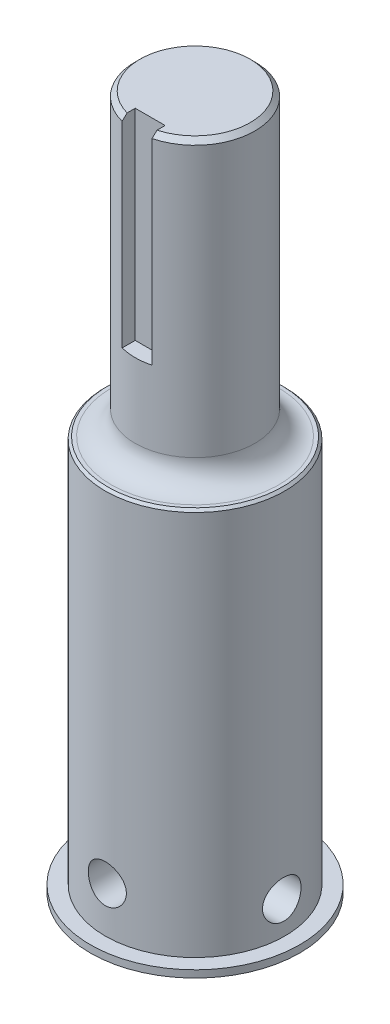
ISO-10303-21;
HEADER;
FILE_DESCRIPTION(('STEP AP214'),'2;1');
FILE_NAME('part.step','',(''),(''),'','','');
FILE_SCHEMA(('AUTOMOTIVE_DESIGN { 1 0 10303 214 1 1 1 1 }'));
ENDSEC;
DATA;
#1=APPLICATION_CONTEXT('core data for automotive mechanical design processes');
#2=APPLICATION_PROTOCOL_DEFINITION('international standard','automotive_design',2000,#1);
#3=PRODUCT_CONTEXT('',#1,'mechanical');
#4=PRODUCT('Part','Part','',(#3));
#5=PRODUCT_RELATED_PRODUCT_CATEGORY('part','',(#4));
#6=PRODUCT_DEFINITION_FORMATION('','',#4);
#7=PRODUCT_DEFINITION_CONTEXT('part definition',#1,'design');
#8=PRODUCT_DEFINITION('design','',#6,#7);
#9=PRODUCT_DEFINITION_SHAPE('','',#8);
#10=(LENGTH_UNIT() NAMED_UNIT(*) SI_UNIT(.MILLI.,.METRE.));
#11=(NAMED_UNIT(*) PLANE_ANGLE_UNIT() SI_UNIT($,.RADIAN.));
#12=(NAMED_UNIT(*) SI_UNIT($,.STERADIAN.) SOLID_ANGLE_UNIT());
#13=UNCERTAINTY_MEASURE_WITH_UNIT(LENGTH_MEASURE(1.E-05),#10,'distance_accuracy_value','');
#14=(GEOMETRIC_REPRESENTATION_CONTEXT(3) GLOBAL_UNCERTAINTY_ASSIGNED_CONTEXT((#13)) GLOBAL_UNIT_ASSIGNED_CONTEXT((#10,
#11,#12)) REPRESENTATION_CONTEXT('',''));
#15=CARTESIAN_POINT('',(0.,0.,0.));
#16=DIRECTION('',(0.,0.,1.));
#17=DIRECTION('',(1.,0.,0.));
#18=AXIS2_PLACEMENT_3D('',#15,#16,#17);
#19=CARTESIAN_POINT('',(0.,73.66,0.));
#20=DIRECTION('',(0.,-1.,0.));
#21=DIRECTION('',(0.,0.,-1.));
#22=AXIS2_PLACEMENT_3D('',#19,#20,#21);
#23=CYLINDRICAL_SURFACE('',#22,6.35);
#24=CARTESIAN_POINT('',(0.,44.45,0.));
#25=DIRECTION('',(0.,1.,0.));
#26=DIRECTION('',(0.,0.,1.));
#27=AXIS2_PLACEMENT_3D('',#24,#25,#26);
#28=CIRCLE('',#27,6.35);
#29=CARTESIAN_POINT('',(0.,44.45,6.35));
#30=VERTEX_POINT('',#29);
#31=EDGE_CURVE('E227',#30,#30,#28,.T.);
#32=ORIENTED_EDGE('',*,*,#31,.T.);
#33=EDGE_LOOP('',(#32));
#34=FACE_BOUND('',#33,.T.);
#35=DIRECTION('',(0.,-1.,0.));
#36=VECTOR('',#35,1.);
#37=CARTESIAN_POINT('',(-1.58750000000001,73.66,6.14836106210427));
#38=LINE('',#37,#36);
#39=CARTESIAN_POINT('',(-1.58750000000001,73.152,6.14836106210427));
#40=VERTEX_POINT('',#39);
#41=CARTESIAN_POINT('',(-1.58750000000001,52.324,6.14836106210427));
#42=VERTEX_POINT('',#41);
#43=EDGE_CURVE('E87',#40,#42,#38,.T.);
#44=ORIENTED_EDGE('',*,*,#43,.F.);
#45=CARTESIAN_POINT('',(0.,73.152,0.));
#46=DIRECTION('',(0.,1.,0.));
#47=DIRECTION('',(0.,0.,1.));
#48=AXIS2_PLACEMENT_3D('',#45,#46,#47);
#49=CIRCLE('',#48,6.35);
#50=CARTESIAN_POINT('',(1.58749999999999,73.152,6.14836106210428));
#51=VERTEX_POINT('',#50);
#52=EDGE_CURVE('E239',#40,#51,#49,.F.);
#53=ORIENTED_EDGE('',*,*,#52,.T.);
#54=DIRECTION('',(0.,-1.,0.));
#55=VECTOR('',#54,1.);
#56=CARTESIAN_POINT('',(1.58749999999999,73.66,6.14836106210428));
#57=LINE('',#56,#55);
#58=CARTESIAN_POINT('',(1.58749999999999,52.324,6.14836106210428));
#59=VERTEX_POINT('',#58);
#60=EDGE_CURVE('E51',#59,#51,#57,.F.);
#61=ORIENTED_EDGE('',*,*,#60,.F.);
#62=CARTESIAN_POINT('',(0.,52.324,0.));
#63=DIRECTION('',(0.,1.,0.));
#64=DIRECTION('',(0.,0.,1.));
#65=AXIS2_PLACEMENT_3D('',#62,#63,#64);
#66=CIRCLE('',#65,6.35);
#67=EDGE_CURVE('E11',#42,#59,#66,.T.);
#68=ORIENTED_EDGE('',*,*,#67,.F.);
#69=EDGE_LOOP('',(#44,#53,#61,#68));
#70=FACE_BOUND('',#69,.T.);
#71=ADVANCED_FACE('F36',(#34,#70),#23,.T.);
#72=CARTESIAN_POINT('',(0.,73.66,0.));
#73=DIRECTION('',(0.,1.,0.));
#74=DIRECTION('',(0.,0.,1.));
#75=AXIS2_PLACEMENT_3D('',#72,#73,#74);
#76=PLANE('',#75);
#77=CARTESIAN_POINT('',(0.,73.66,0.));
#78=DIRECTION('',(0.,1.,0.));
#79=DIRECTION('',(0.,0.,1.));
#80=AXIS2_PLACEMENT_3D('',#77,#78,#79);
#81=CIRCLE('',#80,5.842);
#82=CARTESIAN_POINT('',(1.58749999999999,73.66,5.62217108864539));
#83=VERTEX_POINT('',#82);
#84=CARTESIAN_POINT('',(-1.58750000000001,73.66,5.62217108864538));
#85=VERTEX_POINT('',#84);
#86=EDGE_CURVE('E237',#83,#85,#81,.T.);
#87=ORIENTED_EDGE('',*,*,#86,.T.);
#88=DIRECTION('',(0.,0.,-1.));
#89=VECTOR('',#88,1.);
#90=CARTESIAN_POINT('',(-1.58750000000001,73.66,11.1125));
#91=LINE('',#90,#89);
#92=CARTESIAN_POINT('',(-1.58750000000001,73.66,4.7625));
#93=VERTEX_POINT('',#92);
#94=EDGE_CURVE('E107',#85,#93,#91,.T.);
#95=ORIENTED_EDGE('',*,*,#94,.T.);
#96=DIRECTION('',(-1.,0.,0.));
#97=VECTOR('',#96,1.);
#98=CARTESIAN_POINT('',(-1.58750000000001,73.66,4.7625));
#99=LINE('',#98,#97);
#100=CARTESIAN_POINT('',(1.58749999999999,73.66,4.7625));
#101=VERTEX_POINT('',#100);
#102=EDGE_CURVE('E102',#101,#93,#99,.T.);
#103=ORIENTED_EDGE('',*,*,#102,.F.);
#104=DIRECTION('',(0.,0.,-1.));
#105=VECTOR('',#104,1.);
#106=CARTESIAN_POINT('',(1.58749999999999,73.66,11.1125));
#107=LINE('',#106,#105);
#108=EDGE_CURVE('E109',#83,#101,#107,.T.);
#109=ORIENTED_EDGE('',*,*,#108,.F.);
#110=EDGE_LOOP('',(#87,#95,#103,#109));
#111=FACE_BOUND('',#110,.T.);
#112=ADVANCED_FACE('F156',(#111),#76,.T.);
#113=CARTESIAN_POINT('',(0.,73.66,0.));
#114=DIRECTION('',(0.,-1.,0.));
#115=DIRECTION('',(0.,0.,-1.));
#116=AXIS2_PLACEMENT_3D('',#113,#114,#115);
#117=CONICAL_SURFACE('',#116,5.842,0.78539816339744);
#118=ORIENTED_EDGE('',*,*,#52,.F.);
#119=CARTESIAN_POINT('',(-1.58750000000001,71.2113173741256,8.13727608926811));
#120=CARTESIAN_POINT('',(-1.58750000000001,71.4003636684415,7.944658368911));
#121=CARTESIAN_POINT('',(-1.58750000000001,71.5892918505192,7.75192447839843));
#122=CARTESIAN_POINT('',(-1.58750000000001,71.9668354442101,7.36614901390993));
#123=CARTESIAN_POINT('',(-1.58750000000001,72.1554508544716,7.17310743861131));
#124=CARTESIAN_POINT('',(-1.58750000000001,72.5322778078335,6.78665617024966));
#125=CARTESIAN_POINT('',(-1.58750000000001,72.7204893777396,6.59324650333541));
#126=CARTESIAN_POINT('',(-1.58750000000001,73.096406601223,6.20593657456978));
#127=CARTESIAN_POINT('',(-1.58750000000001,73.2841122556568,6.01203631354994));
#128=CARTESIAN_POINT('',(-1.58750000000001,73.6588712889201,5.62357681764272));
#129=CARTESIAN_POINT('',(-1.58750000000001,73.8459246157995,5.42901753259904));
#130=CARTESIAN_POINT('',(-1.58750000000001,74.2191221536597,5.0390325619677));
#131=CARTESIAN_POINT('',(-1.58750000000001,74.4052663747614,4.84360688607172));
#132=CARTESIAN_POINT('',(-1.58750000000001,74.7762958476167,4.4515347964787));
#133=CARTESIAN_POINT('',(-1.58750000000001,74.9611810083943,4.25488829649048));
#134=CARTESIAN_POINT('',(-1.58750000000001,75.2370998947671,3.95859890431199));
#135=CARTESIAN_POINT('',(-1.58750000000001,75.328839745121,3.85961397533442));
#136=CARTESIAN_POINT('',(-1.58750000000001,75.511724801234,3.66109432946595));
#137=CARTESIAN_POINT('',(-1.58750000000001,75.6028699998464,3.5615596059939));
#138=CARTESIAN_POINT('',(-1.58750000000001,75.693654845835,3.46169561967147));
#139=B_SPLINE_CURVE_WITH_KNOTS('',3,(#119,#120,#121,#122,#123,#124,#125,#126,#127,#128,#129,
#130,#131,#132,#133,#134,#135,#136,#137,#138),.UNSPECIFIED.,.F.,.F.,(4,2,2,2,2,2,2,2,2,4),(0.,
0.809667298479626,1.61933808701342,2.42895335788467,3.2385672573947,4.04824422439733,
4.85791215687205,5.66763798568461,6.07251599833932,6.47739886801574),.UNSPECIFIED.);
#140=EDGE_CURVE('E44',#40,#85,#139,.T.);
#141=ORIENTED_EDGE('',*,*,#140,.T.);
#142=ORIENTED_EDGE('',*,*,#86,.F.);
#143=CARTESIAN_POINT('',(1.58749999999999,75.693654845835,3.46169561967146));
#144=CARTESIAN_POINT('',(1.58749999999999,75.6028699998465,3.5615596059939));
#145=CARTESIAN_POINT('',(1.58749999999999,75.5117248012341,3.66109432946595));
#146=CARTESIAN_POINT('',(1.58749999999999,75.328839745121,3.85961397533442));
#147=CARTESIAN_POINT('',(1.58749999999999,75.2370998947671,3.95859890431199));
#148=CARTESIAN_POINT('',(1.58749999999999,74.9611810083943,4.25488829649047));
#149=CARTESIAN_POINT('',(1.58749999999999,74.7762958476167,4.4515347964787));
#150=CARTESIAN_POINT('',(1.58749999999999,74.4052663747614,4.84360688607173));
#151=CARTESIAN_POINT('',(1.58749999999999,74.2191221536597,5.0390325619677));
#152=CARTESIAN_POINT('',(1.58749999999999,73.8459246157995,5.42901753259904));
#153=CARTESIAN_POINT('',(1.58749999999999,73.6588712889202,5.62357681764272));
#154=CARTESIAN_POINT('',(1.58749999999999,73.2841122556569,6.01203631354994));
#155=CARTESIAN_POINT('',(1.58749999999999,73.0964066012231,6.20593657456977));
#156=CARTESIAN_POINT('',(1.58749999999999,72.7204893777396,6.5932465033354));
#157=CARTESIAN_POINT('',(1.58749999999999,72.5322778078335,6.78665617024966));
#158=CARTESIAN_POINT('',(1.58749999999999,72.1554508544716,7.17310743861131));
#159=CARTESIAN_POINT('',(1.58749999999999,71.9668354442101,7.36614901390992));
#160=CARTESIAN_POINT('',(1.58749999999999,71.5892918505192,7.75192447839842));
#161=CARTESIAN_POINT('',(1.58749999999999,71.4003636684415,7.94465836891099));
#162=CARTESIAN_POINT('',(1.58749999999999,71.2113173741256,8.13727608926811));
#163=B_SPLINE_CURVE_WITH_KNOTS('',3,(#143,#144,#145,#146,#147,#148,#149,#150,#151,#152,#153,
#154,#155,#156,#157,#158,#159,#160,#161,#162),.UNSPECIFIED.,.F.,.F.,(4,2,2,2,2,2,2,2,2,4),(0.,
0.404882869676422,0.809760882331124,1.61948671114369,2.42915464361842,3.23883161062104,
4.04844551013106,4.85806078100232,5.66773156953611,6.47739886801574),.UNSPECIFIED.);
#164=EDGE_CURVE('E145',#83,#51,#163,.T.);
#165=ORIENTED_EDGE('',*,*,#164,.T.);
#166=EDGE_LOOP('',(#118,#141,#142,#165));
#167=FACE_BOUND('',#166,.T.);
#168=ADVANCED_FACE('F150',(#167),#117,.T.);
#169=CARTESIAN_POINT('',(0.,41.91,0.));
#170=DIRECTION('',(0.,1.,0.));
#171=DIRECTION('',(0.,0.,1.));
#172=AXIS2_PLACEMENT_3D('',#169,#170,#171);
#173=PLANE('',#172);
#174=CARTESIAN_POINT('',(0.,41.91,0.));
#175=DIRECTION('',(0.,1.,0.));
#176=DIRECTION('',(0.,0.,1.));
#177=AXIS2_PLACEMENT_3D('',#174,#175,#176);
#178=CIRCLE('',#177,9.271);
#179=CARTESIAN_POINT('',(0.,41.91,9.271));
#180=VERTEX_POINT('',#179);
#181=EDGE_CURVE('E234',#180,#180,#178,.T.);
#182=ORIENTED_EDGE('',*,*,#181,.T.);
#183=EDGE_LOOP('',(#182));
#184=FACE_BOUND('',#183,.T.);
#185=CARTESIAN_POINT('',(0.,41.91,0.));
#186=DIRECTION('',(0.,1.,0.));
#187=DIRECTION('',(0.,0.,1.));
#188=AXIS2_PLACEMENT_3D('',#185,#186,#187);
#189=CIRCLE('',#188,8.89);
#190=CARTESIAN_POINT('',(0.,41.91,8.89));
#191=VERTEX_POINT('',#190);
#192=EDGE_CURVE('E230',#191,#191,#189,.F.);
#193=ORIENTED_EDGE('',*,*,#192,.T.);
#194=EDGE_LOOP('',(#193));
#195=FACE_BOUND('',#194,.T.);
#196=ADVANCED_FACE('F155',(#184,#195),#173,.T.);
#197=CARTESIAN_POINT('',(0.,41.91,0.));
#198=DIRECTION('',(0.,-1.,0.));
#199=DIRECTION('',(0.,0.,-1.));
#200=AXIS2_PLACEMENT_3D('',#197,#198,#199);
#201=CYLINDRICAL_SURFACE('',#200,11.1125);
#202=CARTESIAN_POINT('',(0.,0.761999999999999,0.));
#203=DIRECTION('',(0.,-1.,0.));
#204=DIRECTION('',(0.,0.,-1.));
#205=AXIS2_PLACEMENT_3D('',#202,#203,#204);
#206=CIRCLE('',#205,11.1125);
#207=CARTESIAN_POINT('',(0.,0.761999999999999,-11.1125));
#208=VERTEX_POINT('',#207);
#209=EDGE_CURVE('E215',#208,#208,#206,.T.);
#210=ORIENTED_EDGE('',*,*,#209,.T.);
#211=EDGE_LOOP('',(#210));
#212=FACE_BOUND('',#211,.T.);
#213=CARTESIAN_POINT('',(0.,0.,0.));
#214=DIRECTION('',(0.,1.,0.));
#215=DIRECTION('',(0.,0.,1.));
#216=AXIS2_PLACEMENT_3D('',#213,#214,#215);
#217=CIRCLE('',#216,11.1125);
#218=CARTESIAN_POINT('',(0.,0.,11.1125));
#219=VERTEX_POINT('',#218);
#220=EDGE_CURVE('E222',#219,#219,#217,.T.);
#221=ORIENTED_EDGE('',*,*,#220,.T.);
#222=EDGE_LOOP('',(#221));
#223=FACE_BOUND('',#222,.T.);
#224=ADVANCED_FACE('F38',(#212,#223),#201,.T.);
#225=CARTESIAN_POINT('',(0.,0.,0.));
#226=DIRECTION('',(0.,1.,0.));
#227=DIRECTION('',(0.,0.,1.));
#228=AXIS2_PLACEMENT_3D('',#225,#226,#227);
#229=PLANE('',#228);
#230=CARTESIAN_POINT('',(0.,0.,0.));
#231=DIRECTION('',(0.,1.,0.));
#232=DIRECTION('',(0.,0.,1.));
#233=AXIS2_PLACEMENT_3D('',#230,#231,#232);
#234=CIRCLE('',#233,6.25474999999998);
#235=CARTESIAN_POINT('',(0.,0.,6.25474999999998));
#236=VERTEX_POINT('',#235);
#237=EDGE_CURVE('E225',#236,#236,#234,.T.);
#238=ORIENTED_EDGE('',*,*,#237,.T.);
#239=EDGE_LOOP('',(#238));
#240=FACE_BOUND('',#239,.T.);
#241=ORIENTED_EDGE('',*,*,#220,.F.);
#242=EDGE_LOOP('',(#241));
#243=FACE_BOUND('',#242,.T.);
#244=ADVANCED_FACE('F317',(#240,#243),#229,.F.);
#245=CARTESIAN_POINT('',(0.,25.4,0.));
#246=DIRECTION('',(0.,-1.,0.));
#247=DIRECTION('',(0.,0.,-1.));
#248=AXIS2_PLACEMENT_3D('',#245,#246,#247);
#249=CYLINDRICAL_SURFACE('',#248,6.00075);
#250=CARTESIAN_POINT('',(2.0193,5.588,5.65079003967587));
#251=CARTESIAN_POINT('',(2.01930074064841,5.69792054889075,5.65078948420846));
#252=CARTESIAN_POINT('',(2.0102944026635,5.80783626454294,5.65403238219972));
#253=CARTESIAN_POINT('',(1.9746315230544,6.02440708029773,5.66658454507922));
#254=CARTESIAN_POINT('',(1.9479723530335,6.13106169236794,5.67589471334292));
#255=CARTESIAN_POINT('',(1.87804964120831,6.33793702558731,5.69941003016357));
#256=CARTESIAN_POINT('',(1.83481914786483,6.43817009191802,5.71360543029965));
#257=CARTESIAN_POINT('',(1.73309413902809,6.62999394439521,5.74527745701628));
#258=CARTESIAN_POINT('',(1.67459615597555,6.72158276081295,5.76275482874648));
#259=CARTESIAN_POINT('',(1.54149751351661,6.89717116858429,5.79980323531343));
#260=CARTESIAN_POINT('',(1.46639044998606,6.98077583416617,5.81942716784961));
#261=CARTESIAN_POINT('',(1.30328594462,7.13447281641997,5.85811088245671));
#262=CARTESIAN_POINT('',(1.21528639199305,7.20456291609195,5.87717057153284));
#263=CARTESIAN_POINT('',(1.02599897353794,7.33104100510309,5.9131919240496));
#264=CARTESIAN_POINT('',(0.924419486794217,7.38701408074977,5.93008414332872));
#265=CARTESIAN_POINT('',(0.71262063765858,7.48092167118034,5.95924308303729));
#266=CARTESIAN_POINT('',(0.602403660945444,7.51886114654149,5.97151107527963));
#267=CARTESIAN_POINT('',(0.380600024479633,7.57428203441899,5.98966454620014));
#268=CARTESIAN_POINT('',(0.269200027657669,7.59244022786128,5.99576062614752));
#269=CARTESIAN_POINT('',(0.0447786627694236,7.60993622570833,6.00163157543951));
#270=CARTESIAN_POINT('',(-0.0682422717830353,7.60927897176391,6.00140810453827));
#271=CARTESIAN_POINT('',(-0.287902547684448,7.58958946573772,5.99480721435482));
#272=CARTESIAN_POINT('',(-0.394616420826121,7.571292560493,5.98867607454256));
#273=CARTESIAN_POINT('',(-0.603359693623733,7.51806068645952,5.9712589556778));
#274=CARTESIAN_POINT('',(-0.70538877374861,7.4831245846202,5.95997262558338));
#275=CARTESIAN_POINT('',(-0.903460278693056,7.39718328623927,5.93320226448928));
#276=CARTESIAN_POINT('',(-0.99940528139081,7.34597098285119,5.91766451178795));
#277=CARTESIAN_POINT('',(-1.18155534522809,7.22910252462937,5.8840054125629));
#278=CARTESIAN_POINT('',(-1.26775765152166,7.16344229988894,5.8658833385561));
#279=CARTESIAN_POINT('',(-1.4323470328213,7.01584776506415,5.82793781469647));
#280=CARTESIAN_POINT('',(-1.51016156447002,6.93328432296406,5.80807444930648));
#281=CARTESIAN_POINT('',(-1.65102788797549,6.7561140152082,5.76961459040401));
#282=CARTESIAN_POINT('',(-1.71407731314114,6.66150522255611,5.75101830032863));
#283=CARTESIAN_POINT('',(-1.82443701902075,6.46108382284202,5.71697715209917));
#284=CARTESIAN_POINT('',(-1.87150100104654,6.35512633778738,5.70158291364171));
#285=CARTESIAN_POINT('',(-1.94692287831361,6.13614133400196,5.67627458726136));
#286=CARTESIAN_POINT('',(-1.97528879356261,6.02311686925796,5.66635815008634));
#287=CARTESIAN_POINT('',(-2.01133383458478,5.79876103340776,5.65366141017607));
#288=CARTESIAN_POINT('',(-2.01990232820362,5.68758988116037,5.65057458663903));
#289=CARTESIAN_POINT('',(-2.01863199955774,5.46537871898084,5.65102896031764));
#290=CARTESIAN_POINT('',(-2.00879660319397,5.35433868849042,5.65456892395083));
#291=CARTESIAN_POINT('',(-1.97179742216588,5.13962331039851,5.66757199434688));
#292=CARTESIAN_POINT('',(-1.9452565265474,5.03582632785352,5.67682196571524));
#293=CARTESIAN_POINT('',(-1.87634978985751,4.83418166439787,5.69996701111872));
#294=CARTESIAN_POINT('',(-1.8339811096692,4.73633505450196,5.71386291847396));
#295=CARTESIAN_POINT('',(-1.73307311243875,4.54587881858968,5.74528750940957));
#296=CARTESIAN_POINT('',(-1.67405736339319,4.45353898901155,5.76291869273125));
#297=CARTESIAN_POINT('',(-1.5420679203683,4.27975183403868,5.79963035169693));
#298=CARTESIAN_POINT('',(-1.46909003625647,4.19830779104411,5.81871126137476));
#299=CARTESIAN_POINT('',(-1.30698656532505,4.0444828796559,5.85730756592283));
#300=CARTESIAN_POINT('',(-1.21724331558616,3.97274477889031,5.87679817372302));
#301=CARTESIAN_POINT('',(-1.02651277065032,3.84530218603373,5.91309414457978));
#302=CARTESIAN_POINT('',(-0.925525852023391,3.78959715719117,5.92989959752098));
#303=CARTESIAN_POINT('',(-0.71565311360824,3.69630498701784,5.95885704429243));
#304=CARTESIAN_POINT('',(-0.606822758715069,3.6586027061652,5.97103850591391));
#305=CARTESIAN_POINT('',(-0.383874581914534,3.60219503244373,5.98950165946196));
#306=CARTESIAN_POINT('',(-0.269758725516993,3.58348263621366,5.99578552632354));
#307=CARTESIAN_POINT('',(-0.0453526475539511,3.5662256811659,6.00157820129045));
#308=CARTESIAN_POINT('',(0.064859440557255,3.56675917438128,6.00139672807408));
#309=CARTESIAN_POINT('',(0.283550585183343,3.58569755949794,5.99504494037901));
#310=CARTESIAN_POINT('',(0.392029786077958,3.6041009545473,5.98887512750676));
#311=CARTESIAN_POINT('',(0.602396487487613,3.65764185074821,5.97135569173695));
#312=CARTESIAN_POINT('',(0.704363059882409,3.69249913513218,5.96009293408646));
#313=CARTESIAN_POINT('',(0.901038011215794,3.77769766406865,5.93354778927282));
#314=CARTESIAN_POINT('',(0.995745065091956,3.82804172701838,5.91826467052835));
#315=CARTESIAN_POINT('',(1.17907433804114,3.94494982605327,5.88453902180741));
#316=CARTESIAN_POINT('',(1.26733667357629,4.01204991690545,5.86599973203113));
#317=CARTESIAN_POINT('',(1.4316487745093,4.15965856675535,5.82807910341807));
#318=CARTESIAN_POINT('',(1.50769459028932,4.24017144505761,5.80869749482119));
#319=CARTESIAN_POINT('',(1.64851858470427,4.41618023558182,5.7703495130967));
#320=CARTESIAN_POINT('',(1.71272244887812,4.5121476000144,5.75143097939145));
#321=CARTESIAN_POINT('',(1.82404991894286,4.71410083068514,5.71710177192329));
#322=CARTESIAN_POINT('',(1.87117758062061,4.82008431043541,5.70169026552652));
#323=CARTESIAN_POINT('',(1.94526371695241,5.03489856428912,5.67683246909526));
#324=CARTESIAN_POINT('',(1.97293464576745,5.14345874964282,5.66717768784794));
#325=CARTESIAN_POINT('',(2.00994908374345,5.36401513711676,5.6541578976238));
#326=CARTESIAN_POINT('',(2.01929924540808,5.47601007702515,5.65079060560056));
#327=CARTESIAN_POINT('',(2.0193,5.588,5.65079003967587));
#328=B_SPLINE_CURVE_WITH_KNOTS('',3,(#250,#251,#252,#253,#254,#255,#256,#257,#258,#259,#260,
#261,#262,#263,#264,#265,#266,#267,#268,#269,#270,#271,#272,#273,#274,#275,#276,#277,#278,#279,
#280,#281,#282,#283,#284,#285,#286,#287,#288,#289,#290,#291,#292,#293,#294,#295,#296,#297,#298,
#299,#300,#301,#302,#303,#304,#305,#306,#307,#308,#309,#310,#311,#312,#313,#314,#315,#316,#317,
#318,#319,#320,#321,#322,#323,#324,#325,#326,#327),.UNSPECIFIED.,.T.,.F.,(4,2,2,2,2,2,2,2,2,2,2,
2,2,2,2,2,2,2,2,2,2,2,2,2,2,2,2,2,2,2,2,2,2,2,2,2,2,2,4),(0.,0.329346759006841,
0.658742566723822,0.98748484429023,1.31630185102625,1.65702606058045,1.99780611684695,
2.34766743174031,2.69743245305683,3.03481363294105,3.37210620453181,3.69591997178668,
4.01975579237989,4.34788938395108,4.67611552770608,5.02007208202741,5.36408373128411,
5.71317793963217,6.06212231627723,6.39505775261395,6.72793121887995,7.04907380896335,
7.3702740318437,7.70180894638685,8.03344351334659,8.38138892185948,8.72932268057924,
9.07500033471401,9.42055045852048,9.74957049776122,10.0785629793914,10.4021442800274,
10.7257845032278,11.0615248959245,11.3973736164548,11.7466937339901,12.095930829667,
12.4315998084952,12.767146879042),.UNSPECIFIED.);
#329=CARTESIAN_POINT('',(2.0193,5.588,5.65079003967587));
#330=VERTEX_POINT('',#329);
#331=EDGE_CURVE('E114',#330,#330,#328,.T.);
#332=ORIENTED_EDGE('',*,*,#331,.T.);
#333=EDGE_LOOP('',(#332));
#334=FACE_BOUND('',#333,.T.);
#335=CARTESIAN_POINT('',(5.67407170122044,4.20590980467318,-1.95292367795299));
#336=CARTESIAN_POINT('',(5.67407115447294,4.31583035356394,-1.9529244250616));
#337=CARTESIAN_POINT('',(5.67720825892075,4.42574606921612,-1.94388069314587));
#338=CARTESIAN_POINT('',(5.68934152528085,4.64231688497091,-1.90807312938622));
#339=CARTESIAN_POINT('',(5.69833855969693,4.74897149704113,-1.88130665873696));
#340=CARTESIAN_POINT('',(5.72103263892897,4.9558468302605,-1.81111310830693));
#341=CARTESIAN_POINT('',(5.73472032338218,5.0560798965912,-1.76771918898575));
#342=CARTESIAN_POINT('',(5.76519777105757,5.24790374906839,-1.66562991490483));
#343=CARTESIAN_POINT('',(5.78198823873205,5.33949256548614,-1.60693108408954));
#344=CARTESIAN_POINT('',(5.81747394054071,5.51508097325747,-1.4734073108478));
#345=CARTESIAN_POINT('',(5.83621613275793,5.59868563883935,-1.39807537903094));
#346=CARTESIAN_POINT('',(5.87298530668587,5.75238262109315,-1.23452863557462));
#347=CARTESIAN_POINT('',(5.89101217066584,5.82247272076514,-1.14631171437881));
#348=CARTESIAN_POINT('',(5.92481225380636,5.94895080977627,-0.956615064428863));
#349=CARTESIAN_POINT('',(5.94051261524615,6.00492388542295,-0.854844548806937));
#350=CARTESIAN_POINT('',(5.96718688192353,6.09883147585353,-0.642718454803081));
#351=CARTESIAN_POINT('',(5.97816208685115,6.13677095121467,-0.532365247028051));
#352=CARTESIAN_POINT('',(5.99371436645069,6.19219183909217,-0.310364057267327));
#353=CARTESIAN_POINT('',(5.99850421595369,6.21035003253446,-0.198900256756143));
#354=CARTESIAN_POINT('',(6.00174413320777,6.22784603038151,0.025574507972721));
#355=CARTESIAN_POINT('',(6.00019586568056,6.22718877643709,0.138585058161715));
#356=CARTESIAN_POINT('',(5.99102060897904,6.2074992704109,0.358152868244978));
#357=CARTESIAN_POINT('',(5.9836390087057,6.18920236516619,0.464787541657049));
#358=CARTESIAN_POINT('',(5.96377623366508,6.1359704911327,0.673312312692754));
#359=CARTESIAN_POINT('',(5.95129471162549,6.10103438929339,0.775202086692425));
#360=CARTESIAN_POINT('',(5.9222044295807,6.01509309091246,0.972946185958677));
#361=CARTESIAN_POINT('',(5.90554309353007,5.96388078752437,1.06870246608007));
#362=CARTESIAN_POINT('',(5.86975117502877,5.84701232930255,1.25044546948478));
#363=CARTESIAN_POINT('',(5.85061989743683,5.78135210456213,1.33642942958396));
#364=CARTESIAN_POINT('',(5.8107476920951,5.63375756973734,1.50056271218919));
#365=CARTESIAN_POINT('',(5.78997356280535,5.55119412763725,1.57813906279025));
#366=CARTESIAN_POINT('',(5.74986513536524,5.37402381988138,1.71854488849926));
#367=CARTESIAN_POINT('',(5.73053106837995,5.27941502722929,1.78137199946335));
#368=CARTESIAN_POINT('',(5.69519864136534,5.0789936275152,1.89132509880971));
#369=CARTESIAN_POINT('',(5.67925378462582,4.97303614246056,1.93820539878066));
#370=CARTESIAN_POINT('',(5.65306311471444,4.75405113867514,2.01332543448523));
#371=CARTESIAN_POINT('',(5.64281485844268,4.64102667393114,2.04157316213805));
#372=CARTESIAN_POINT('',(5.62969647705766,4.41667083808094,2.07746689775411));
#373=CARTESIAN_POINT('',(5.6265094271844,4.30549968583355,2.08599861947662));
#374=CARTESIAN_POINT('',(5.62697866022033,4.08328852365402,2.08473370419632));
#375=CARTESIAN_POINT('',(5.63063366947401,3.9722484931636,2.07494047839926));
#376=CARTESIAN_POINT('',(5.64406954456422,3.75753311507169,2.03809625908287));
#377=CARTESIAN_POINT('',(5.65362998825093,3.6537361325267,2.01166561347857));
#378=CARTESIAN_POINT('',(5.67758115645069,3.45209146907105,1.94303491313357));
#379=CARTESIAN_POINT('',(5.69197274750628,3.35424485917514,1.90083202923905));
#380=CARTESIAN_POINT('',(5.72457800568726,3.16378862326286,1.80029931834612));
#381=CARTESIAN_POINT('',(5.74289975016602,3.07144879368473,1.74149429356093));
#382=CARTESIAN_POINT('',(5.78115604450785,2.89766163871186,1.60994424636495));
#383=CARTESIAN_POINT('',(5.80109107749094,2.81621759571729,1.53719503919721));
#384=CARTESIAN_POINT('',(5.84158487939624,2.66239268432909,1.37555512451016));
#385=CARTESIAN_POINT('',(5.86212610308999,2.5906545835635,1.28604650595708));
#386=CARTESIAN_POINT('',(5.90065529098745,2.46321199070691,1.09575451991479));
#387=CARTESIAN_POINT('',(5.91864334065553,2.40750696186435,0.994971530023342));
#388=CARTESIAN_POINT('',(5.95005889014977,2.31421479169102,0.785452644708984));
#389=CARTESIAN_POINT('',(5.96351520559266,2.27651251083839,0.676772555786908));
#390=CARTESIAN_POINT('',(5.98459045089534,2.22010483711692,0.454056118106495));
#391=CARTESIAN_POINT('',(5.99221153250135,2.20139244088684,0.34002176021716));
#392=CARTESIAN_POINT('',(6.00063425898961,2.18413548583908,0.115699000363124));
#393=CARTESIAN_POINT('',(6.00174468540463,2.18466897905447,0.00549235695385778));
#394=CARTESIAN_POINT('',(5.99795679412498,2.20360736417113,-0.213258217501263));
#395=CARTESIAN_POINT('',(5.99305897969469,2.22201075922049,-0.321802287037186));
#396=CARTESIAN_POINT('',(5.97800662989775,2.27555165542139,-0.532359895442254));
#397=CARTESIAN_POINT('',(5.96793988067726,2.31040893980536,-0.634451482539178));
#398=CARTESIAN_POINT('',(5.94370194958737,2.39560746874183,-0.831424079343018));
#399=CARTESIAN_POINT('',(5.92953002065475,2.44595153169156,-0.926303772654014));
#400=CARTESIAN_POINT('',(5.89795564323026,2.56285963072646,-1.11001577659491));
#401=CARTESIAN_POINT('',(5.88045222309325,2.62995972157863,-1.19848936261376));
#402=CARTESIAN_POINT('',(5.84446023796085,2.77756837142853,-1.36323467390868));
#403=CARTESIAN_POINT('',(5.82597135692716,2.8580812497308,-1.43950245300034));
#404=CARTESIAN_POINT('',(5.78927672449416,3.034090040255,-1.58076628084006));
#405=CARTESIAN_POINT('',(5.77111207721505,3.13005740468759,-1.64518749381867));
#406=CARTESIAN_POINT('',(5.73809018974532,3.33201063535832,-1.7569097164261));
#407=CARTESIAN_POINT('',(5.72323216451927,3.43799411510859,-1.80421479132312));
#408=CARTESIAN_POINT('',(5.69924450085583,3.6528083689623,-1.87858721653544));
#409=CARTESIAN_POINT('',(5.68991473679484,3.761368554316,-1.90636941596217));
#410=CARTESIAN_POINT('',(5.67732971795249,3.98192494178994,-1.94353392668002));
#411=CARTESIAN_POINT('',(5.67407225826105,4.09391988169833,-1.95292291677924));
#412=CARTESIAN_POINT('',(5.67407170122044,4.20590980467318,-1.95292367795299));
#413=B_SPLINE_CURVE_WITH_KNOTS('',3,(#335,#336,#337,#338,#339,#340,#341,#342,#343,#344,#345,
#346,#347,#348,#349,#350,#351,#352,#353,#354,#355,#356,#357,#358,#359,#360,#361,#362,#363,#364,
#365,#366,#367,#368,#369,#370,#371,#372,#373,#374,#375,#376,#377,#378,#379,#380,#381,#382,#383,
#384,#385,#386,#387,#388,#389,#390,#391,#392,#393,#394,#395,#396,#397,#398,#399,#400,#401,#402,
#403,#404,#405,#406,#407,#408,#409,#410,#411,#412),.UNSPECIFIED.,.T.,.F.,(4,2,2,2,2,2,2,2,2,2,2,
2,2,2,2,2,2,2,2,2,2,2,2,2,2,2,2,2,2,2,2,2,2,2,2,2,2,2,4),(0.,0.329346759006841,
0.658742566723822,0.98748484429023,1.31630185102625,1.65702606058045,1.99780611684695,
2.34766743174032,2.69743245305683,3.03481363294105,3.37210620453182,3.69591997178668,
4.01975579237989,4.34788938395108,4.67611552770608,5.02007208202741,5.36408373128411,
5.71317793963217,6.06212231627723,6.39505775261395,6.72793121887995,7.04907380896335,
7.3702740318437,7.70180894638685,8.03344351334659,8.38138892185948,8.72932268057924,
9.07500033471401,9.42055045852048,9.74957049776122,10.0785629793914,10.4021442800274,
10.7257845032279,11.0615248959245,11.3973736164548,11.7466937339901,12.095930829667,
12.4315998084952,12.767146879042),.UNSPECIFIED.);
#414=CARTESIAN_POINT('',(5.67407170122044,4.20590980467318,-1.95292367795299));
#415=VERTEX_POINT('',#414);
#416=EDGE_CURVE('E188',#415,#415,#413,.T.);
#417=ORIENTED_EDGE('',*,*,#416,.T.);
#418=EDGE_LOOP('',(#417));
#419=FACE_BOUND('',#418,.T.);
#420=CARTESIAN_POINT('',(0.,0.25399999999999,0.));
#421=DIRECTION('',(0.,1.,0.));
#422=DIRECTION('',(0.,0.,1.));
#423=AXIS2_PLACEMENT_3D('',#420,#421,#422);
#424=CIRCLE('',#423,6.00075);
#425=CARTESIAN_POINT('',(0.,0.25399999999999,6.00075));
#426=VERTEX_POINT('',#425);
#427=EDGE_CURVE('E393',#426,#426,#424,.F.);
#428=ORIENTED_EDGE('',*,*,#427,.T.);
#429=EDGE_LOOP('',(#428));
#430=FACE_BOUND('',#429,.T.);
#431=CARTESIAN_POINT('',(0.,25.4,0.));
#432=DIRECTION('',(0.,-1.,0.));
#433=DIRECTION('',(0.,0.,-1.));
#434=AXIS2_PLACEMENT_3D('',#431,#432,#433);
#435=CIRCLE('',#434,6.00075);
#436=CARTESIAN_POINT('',(0.,25.4,-6.00075));
#437=VERTEX_POINT('',#436);
#438=EDGE_CURVE('E217',#437,#437,#435,.T.);
#439=ORIENTED_EDGE('',*,*,#438,.F.);
#440=EDGE_LOOP('',(#439));
#441=FACE_BOUND('',#440,.T.);
#442=ADVANCED_FACE('F311',(#334,#419,#430,#441),#249,.F.);
#443=CARTESIAN_POINT('',(0.,25.4,0.));
#444=DIRECTION('',(0.,-1.,0.));
#445=DIRECTION('',(0.,0.,-1.));
#446=AXIS2_PLACEMENT_3D('',#443,#444,#445);
#447=PLANE('',#446);
#448=ORIENTED_EDGE('',*,*,#438,.T.);
#449=EDGE_LOOP('',(#448));
#450=FACE_BOUND('',#449,.T.);
#451=ADVANCED_FACE('F316',(#450),#447,.T.);
#452=CARTESIAN_POINT('',(0.,0.25399999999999,0.));
#453=DIRECTION('',(0.,-1.,0.));
#454=DIRECTION('',(0.,0.,-1.));
#455=AXIS2_PLACEMENT_3D('',#452,#453,#454);
#456=CONICAL_SURFACE('',#455,6.00075,0.785398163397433);
#457=ORIENTED_EDGE('',*,*,#237,.F.);
#458=EDGE_LOOP('',(#457));
#459=FACE_BOUND('',#458,.T.);
#460=ORIENTED_EDGE('',*,*,#427,.F.);
#461=EDGE_LOOP('',(#460));
#462=FACE_BOUND('',#461,.T.);
#463=ADVANCED_FACE('F354',(#459,#462),#456,.F.);
#464=CARTESIAN_POINT('',(0.,0.762,0.));
#465=DIRECTION('',(0.,-1.,0.));
#466=DIRECTION('',(0.,0.,-1.));
#467=AXIS2_PLACEMENT_3D('',#464,#465,#466);
#468=PLANE('',#467);
#469=CARTESIAN_POINT('',(0.,0.762,0.));
#470=DIRECTION('',(0.,-1.,0.));
#471=DIRECTION('',(0.,0.,-1.));
#472=AXIS2_PLACEMENT_3D('',#469,#470,#471);
#473=CIRCLE('',#472,9.525);
#474=CARTESIAN_POINT('',(0.,0.762,-9.525));
#475=VERTEX_POINT('',#474);
#476=EDGE_CURVE('E187',#475,#475,#473,.T.);
#477=ORIENTED_EDGE('',*,*,#476,.T.);
#478=EDGE_LOOP('',(#477));
#479=FACE_BOUND('',#478,.T.);
#480=ORIENTED_EDGE('',*,*,#209,.F.);
#481=EDGE_LOOP('',(#480));
#482=FACE_BOUND('',#481,.T.);
#483=ADVANCED_FACE('F177',(#479,#482),#468,.F.);
#484=CARTESIAN_POINT('',(0.,41.91,0.));
#485=DIRECTION('',(0.,-1.,0.));
#486=DIRECTION('',(0.,0.,-1.));
#487=AXIS2_PLACEMENT_3D('',#484,#485,#486);
#488=CYLINDRICAL_SURFACE('',#487,9.525);
#489=CARTESIAN_POINT('',(2.0193,5.588,9.30849356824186));
#490=CARTESIAN_POINT('',(2.01929603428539,5.70004888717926,9.30849582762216));
#491=CARTESIAN_POINT('',(2.00994207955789,5.81214626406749,9.3105387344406));
#492=CARTESIAN_POINT('',(1.97281073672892,6.0331593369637,9.31847573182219));
#493=CARTESIAN_POINT('',(1.94501950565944,6.14207257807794,9.32437271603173));
#494=CARTESIAN_POINT('',(1.87192289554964,6.35348821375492,9.33932066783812));
#495=CARTESIAN_POINT('',(1.82663606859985,6.45599726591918,9.34836829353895));
#496=CARTESIAN_POINT('',(1.71988607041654,6.65196305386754,9.36859408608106));
#497=CARTESIAN_POINT('',(1.65842344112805,6.74542009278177,9.37977218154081));
#498=CARTESIAN_POINT('',(1.52002642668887,6.92211535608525,9.40319768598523));
#499=CARTESIAN_POINT('',(1.44288400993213,7.0051889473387,9.41545806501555));
#500=CARTESIAN_POINT('',(1.27576644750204,7.15731898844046,9.43955293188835));
#501=CARTESIAN_POINT('',(1.1857903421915,7.22637438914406,9.45138738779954));
#502=CARTESIAN_POINT('',(0.994460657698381,7.34915450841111,9.47343774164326));
#503=CARTESIAN_POINT('',(0.893003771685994,7.40272157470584,9.48363655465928));
#504=CARTESIAN_POINT('',(0.682276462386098,7.49198547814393,9.50112028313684));
#505=CARTESIAN_POINT('',(0.573006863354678,7.52768419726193,9.50840550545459));
#506=CARTESIAN_POINT('',(0.351466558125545,7.57968219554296,9.51914955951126));
#507=CARTESIAN_POINT('',(0.239263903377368,7.5962598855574,9.52266325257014));
#508=CARTESIAN_POINT('',(0.0136186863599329,7.61041504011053,9.52565820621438));
#509=CARTESIAN_POINT('',(-0.0998237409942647,7.60799455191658,9.52513990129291));
#510=CARTESIAN_POINT('',(-0.32281128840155,7.58443081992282,9.52017140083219));
#511=CARTESIAN_POINT('',(-0.432389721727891,7.56358759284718,9.51578421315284));
#512=CARTESIAN_POINT('',(-0.646457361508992,7.50424731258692,9.50364240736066));
#513=CARTESIAN_POINT('',(-0.750946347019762,7.46574949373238,9.49588764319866));
#514=CARTESIAN_POINT('',(-0.952710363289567,7.3719228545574,9.47777975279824));
#515=CARTESIAN_POINT('',(-1.04993020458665,7.31647890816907,9.46740894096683));
#516=CARTESIAN_POINT('',(-1.2337961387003,7.19041946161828,9.44520838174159));
#517=CARTESIAN_POINT('',(-1.32044087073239,7.11980201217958,9.43337844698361));
#518=CARTESIAN_POINT('',(-1.48248003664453,6.96376209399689,9.4092895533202));
#519=CARTESIAN_POINT('',(-1.55762124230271,6.87807703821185,9.39702672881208));
#520=CARTESIAN_POINT('',(-1.6925128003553,6.69519613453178,9.3736719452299));
#521=CARTESIAN_POINT('',(-1.75226278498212,6.59800001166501,9.36258001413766));
#522=CARTESIAN_POINT('',(-1.85477896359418,6.39446354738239,9.3428135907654));
#523=CARTESIAN_POINT('',(-1.89749984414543,6.28809971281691,9.33414556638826));
#524=CARTESIAN_POINT('',(-1.96438678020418,6.06947621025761,9.3202997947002));
#525=CARTESIAN_POINT('',(-1.98855558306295,5.95721741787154,9.31512153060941));
#526=CARTESIAN_POINT('',(-2.01726482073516,5.732297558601,9.30894630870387));
#527=CARTESIAN_POINT('',(-2.02217285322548,5.61968550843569,9.30787105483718));
#528=CARTESIAN_POINT('',(-2.01321422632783,5.39525214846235,9.30981277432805));
#529=CARTESIAN_POINT('',(-1.99934877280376,5.28343078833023,9.31282948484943));
#530=CARTESIAN_POINT('',(-1.95355496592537,5.06501652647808,9.32254151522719));
#531=CARTESIAN_POINT('',(-1.92182683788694,4.95837966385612,9.32919603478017));
#532=CARTESIAN_POINT('',(-1.84142411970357,4.75193544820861,9.34539746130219));
#533=CARTESIAN_POINT('',(-1.79274798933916,4.65212871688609,9.35494463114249));
#534=CARTESIAN_POINT('',(-1.67901294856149,4.46058057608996,9.37602908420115));
#535=CARTESIAN_POINT('',(-1.61372627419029,4.36897742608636,9.38759326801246));
#536=CARTESIAN_POINT('',(-1.46892346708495,4.19789234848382,9.41133676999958));
#537=CARTESIAN_POINT('',(-1.38940567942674,4.11841183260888,9.42351615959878));
#538=CARTESIAN_POINT('',(-1.21673926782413,3.97241358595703,9.44737439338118));
#539=CARTESIAN_POINT('',(-1.12337737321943,3.90614571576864,9.45904082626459));
#540=CARTESIAN_POINT('',(-0.926632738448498,3.79023526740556,9.48033504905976));
#541=CARTESIAN_POINT('',(-0.823250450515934,3.74059193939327,9.48996293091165));
#542=CARTESIAN_POINT('',(-0.610022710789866,3.65969375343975,9.50604266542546));
#543=CARTESIAN_POINT('',(-0.50022138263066,3.62832661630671,9.51251387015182));
#544=CARTESIAN_POINT('',(-0.276755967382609,3.5845185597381,9.52163455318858));
#545=CARTESIAN_POINT('',(-0.163092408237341,3.57207506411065,9.52428455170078));
#546=CARTESIAN_POINT('',(0.0624937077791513,3.56657744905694,9.52544995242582));
#547=CARTESIAN_POINT('',(0.174406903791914,3.57314933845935,9.52404510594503));
#548=CARTESIAN_POINT('',(0.39549519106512,3.6046633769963,9.5174283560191));
#549=CARTESIAN_POINT('',(0.504670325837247,3.62960523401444,9.51221651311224));
#550=CARTESIAN_POINT('',(0.716914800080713,3.69697665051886,9.49857594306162));
#551=CARTESIAN_POINT('',(0.820000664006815,3.73935613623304,9.49015643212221));
#552=CARTESIAN_POINT('',(1.01764972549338,3.84034979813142,9.4710023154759));
#553=CARTESIAN_POINT('',(1.11221214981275,3.89896544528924,9.46026750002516));
#554=CARTESIAN_POINT('',(1.29196368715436,4.03200258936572,9.43741599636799));
#555=CARTESIAN_POINT('',(1.37695418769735,4.1066888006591,9.42527797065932));
#556=CARTESIAN_POINT('',(1.53332402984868,4.26920929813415,9.4011072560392));
#557=CARTESIAN_POINT('',(1.60470010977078,4.35704672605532,9.38907459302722));
#558=CARTESIAN_POINT('',(1.73266295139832,4.5446842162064,9.36631153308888));
#559=CARTESIAN_POINT('',(1.7890555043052,4.64461901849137,9.35559911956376));
#560=CARTESIAN_POINT('',(1.88415679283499,4.85275016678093,9.33691305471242));
#561=CARTESIAN_POINT('',(1.92288089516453,4.96093923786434,9.32893702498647));
#562=CARTESIAN_POINT('',(1.97441124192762,5.15574170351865,9.3181451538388));
#563=CARTESIAN_POINT('',(1.99121305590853,5.24127741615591,9.31454923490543));
#564=CARTESIAN_POINT('',(2.01365873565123,5.41386570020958,9.30972261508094));
#565=CARTESIAN_POINT('',(2.01930308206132,5.50091820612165,9.30849181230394));
#566=CARTESIAN_POINT('',(2.0193,5.588,9.30849356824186));
#567=B_SPLINE_CURVE_WITH_KNOTS('',3,(#489,#490,#491,#492,#493,#494,#495,#496,#497,#498,#499,
#500,#501,#502,#503,#504,#505,#506,#507,#508,#509,#510,#511,#512,#513,#514,#515,#516,#517,#518,
#519,#520,#521,#522,#523,#524,#525,#526,#527,#528,#529,#530,#531,#532,#533,#534,#535,#536,#537,
#538,#539,#540,#541,#542,#543,#544,#545,#546,#547,#548,#549,#550,#551,#552,#553,#554,#555,#556,
#557,#558,#559,#560,#561,#562,#563,#564,#565,#566),.UNSPECIFIED.,.T.,.F.,(4,2,2,2,2,2,2,2,2,2,2,
2,2,2,2,2,2,2,2,2,2,2,2,2,2,2,2,2,2,2,2,2,2,2,2,2,2,2,4),(0.,0.335827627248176,
0.671907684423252,1.00763234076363,1.34334575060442,1.68384405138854,2.02436782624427,
2.36824464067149,2.71208522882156,3.05085349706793,3.38958525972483,3.72290032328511,
4.05622984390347,4.39187621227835,4.72756572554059,5.06982184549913,5.41208614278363,
5.75525520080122,6.09837342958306,6.4349103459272,6.77142564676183,7.10424192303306,
7.43708845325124,7.77477121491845,8.11249327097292,8.45609694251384,8.79968511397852,
9.14113957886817,9.48254755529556,9.81728669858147,10.1520205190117,10.4857997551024,
10.8196092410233,11.1594078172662,11.4992876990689,11.8433789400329,12.1871703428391,
12.4481790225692,12.7091764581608),.UNSPECIFIED.);
#568=CARTESIAN_POINT('',(2.0193,5.588,9.30849356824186));
#569=VERTEX_POINT('',#568);
#570=EDGE_CURVE('E121',#569,#569,#567,.T.);
#571=ORIENTED_EDGE('',*,*,#570,.F.);
#572=EDGE_LOOP('',(#571));
#573=FACE_BOUND('',#572,.T.);
#574=CARTESIAN_POINT('',(9.33152393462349,4.20590980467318,-1.91004870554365));
#575=CARTESIAN_POINT('',(9.33152614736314,4.31795869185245,-1.91004471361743));
#576=CARTESIAN_POINT('',(9.33345926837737,4.43005606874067,-1.9006674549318));
#577=CARTESIAN_POINT('',(9.34096047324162,4.65106914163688,-1.86344562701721));
#578=CARTESIAN_POINT('',(9.34653128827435,4.75998238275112,-1.8355871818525));
#579=CARTESIAN_POINT('',(9.36062138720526,4.97139801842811,-1.76232037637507));
#580=CARTESIAN_POINT('',(9.36913754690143,5.07390707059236,-1.71693060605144));
#581=CARTESIAN_POINT('',(9.3881106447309,5.26987285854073,-1.60995085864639));
#582=CARTESIAN_POINT('',(9.39856751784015,5.36332989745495,-1.5483614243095));
#583=CARTESIAN_POINT('',(9.42036914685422,5.54002516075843,-1.40969932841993));
#584=CARTESIAN_POINT('',(9.43172443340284,5.62309875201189,-1.33241849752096));
#585=CARTESIAN_POINT('',(9.4538587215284,5.77522879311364,-1.16502998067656));
#586=CARTESIAN_POINT('',(9.46463767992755,5.84428419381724,-1.07492133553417));
#587=CARTESIAN_POINT('',(9.48444378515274,5.96706431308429,-0.883346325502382));
#588=CARTESIAN_POINT('',(9.49345263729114,6.02063137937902,-0.781776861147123));
#589=CARTESIAN_POINT('',(9.50846505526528,6.10989528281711,-0.570859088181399));
#590=CARTESIAN_POINT('',(9.51446893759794,6.14559400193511,-0.46151160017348));
#591=CARTESIAN_POINT('',(9.52261539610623,6.19759200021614,-0.239860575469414));
#592=CARTESIAN_POINT('',(9.52481362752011,6.21416969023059,-0.127624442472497));
#593=CARTESIAN_POINT('',(9.52516340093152,6.22832484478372,0.0980403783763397));
#594=CARTESIAN_POINT('',(9.52331537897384,6.22590435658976,0.211468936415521));
#595=CARTESIAN_POINT('',(9.51573339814,6.202340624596,0.434382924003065));
#596=CARTESIAN_POINT('',(9.51006205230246,6.18149739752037,0.543902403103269));
#597=CARTESIAN_POINT('',(9.49541181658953,6.12215711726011,0.757813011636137));
#598=CARTESIAN_POINT('',(9.48643278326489,6.08365929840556,0.862203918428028));
#599=CARTESIAN_POINT('',(9.46596109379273,5.98983265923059,1.06374181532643));
#600=CARTESIAN_POINT('',(9.45445140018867,5.93438871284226,1.16083341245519));
#601=CARTESIAN_POINT('',(9.43009712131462,5.80832926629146,1.34442648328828));
#602=CARTESIAN_POINT('',(9.41725236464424,5.73771181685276,1.43092659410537));
#603=CARTESIAN_POINT('',(9.3912657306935,5.58167189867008,1.59267226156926));
#604=CARTESIAN_POINT('',(9.37812295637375,5.49598684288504,1.6676645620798));
#605=CARTESIAN_POINT('',(9.35318860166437,5.31310593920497,1.80227309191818));
#606=CARTESIAN_POINT('',(9.34139705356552,5.2159098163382,1.86188895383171));
#607=CARTESIAN_POINT('',(9.32043031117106,5.01237335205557,1.96416639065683));
#608=CARTESIAN_POINT('',(9.31126211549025,4.90600951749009,2.00678273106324));
#609=CARTESIAN_POINT('',(9.29663325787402,4.68738601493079,2.07350277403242));
#610=CARTESIAN_POINT('',(9.29117204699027,4.57512722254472,2.0976092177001));
#611=CARTESIAN_POINT('',(9.28466072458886,4.35020736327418,2.12624409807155));
#612=CARTESIAN_POINT('',(9.28352801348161,4.23759531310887,2.13113918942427));
#613=CARTESIAN_POINT('',(9.28557461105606,4.01316195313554,2.12220393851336));
#614=CARTESIAN_POINT('',(9.28875364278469,3.90134059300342,2.10837479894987));
#615=CARTESIAN_POINT('',(9.29900179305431,3.68292633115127,2.06269798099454));
#616=CARTESIAN_POINT('',(9.30602776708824,3.57628946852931,2.03105003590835));
#617=CARTESIAN_POINT('',(9.3231705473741,3.36984525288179,1.95084275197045));
#618=CARTESIAN_POINT('',(9.33328763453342,3.27003852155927,1.90228187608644));
#619=CARTESIAN_POINT('',(9.35570382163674,3.07849038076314,1.78880179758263));
#620=CARTESIAN_POINT('',(9.36803249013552,2.98688723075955,1.7236551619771));
#621=CARTESIAN_POINT('',(9.39347171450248,2.815802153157,1.57914062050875));
#622=CARTESIAN_POINT('',(9.40658236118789,2.73632163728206,1.49977106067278));
#623=CARTESIAN_POINT('',(9.43246292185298,2.59032339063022,1.32739617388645));
#624=CARTESIAN_POINT('',(9.44522292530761,2.52405552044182,1.23417744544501));
#625=CARTESIAN_POINT('',(9.46882189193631,2.40814507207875,1.03769593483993));
#626=CARTESIAN_POINT('',(9.47966094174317,2.35850174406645,0.934433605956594));
#627=CARTESIAN_POINT('',(9.49823899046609,2.27760355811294,0.721408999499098));
#628=CARTESIAN_POINT('',(9.50599682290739,2.24623642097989,0.611691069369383));
#629=CARTESIAN_POINT('',(9.51773630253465,2.20242836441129,0.38834791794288));
#630=CARTESIAN_POINT('',(9.52171846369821,2.18998486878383,0.274723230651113));
#631=CARTESIAN_POINT('',(9.52552806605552,2.18448725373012,0.0491662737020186));
#632=CARTESIAN_POINT('',(9.52543514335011,2.19105914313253,-0.0627557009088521));
#633=CARTESIAN_POINT('',(9.52141040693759,2.22257318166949,-0.28390635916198));
#634=CARTESIAN_POINT('',(9.51747865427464,2.24751503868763,-0.393135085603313));
#635=CARTESIAN_POINT('',(9.50632691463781,2.31488645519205,-0.605524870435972));
#636=CARTESIAN_POINT('',(9.4991163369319,2.35726594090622,-0.708702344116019));
#637=CARTESIAN_POINT('',(9.4822803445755,2.4582596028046,-0.906562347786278));
#638=CARTESIAN_POINT('',(9.47265471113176,2.51687524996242,-1.00124410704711));
#639=CARTESIAN_POINT('',(9.4519117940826,2.6499123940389,-1.18125115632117));
#640=CARTESIAN_POINT('',(9.44077084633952,2.72459860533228,-1.26637809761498));
#641=CARTESIAN_POINT('',(9.41843473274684,2.88711910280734,-1.42302052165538));
#642=CARTESIAN_POINT('',(9.407239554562,2.9749565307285,-1.49453274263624));
#643=CARTESIAN_POINT('',(9.38597801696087,3.16259402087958,-1.62275361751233));
#644=CARTESIAN_POINT('',(9.37592736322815,3.26252882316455,-1.67926786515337));
#645=CARTESIAN_POINT('',(9.35835734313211,3.47065997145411,-1.77458165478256));
#646=CARTESIAN_POINT('',(9.35083577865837,3.57884904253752,-1.81339659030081));
#647=CARTESIAN_POINT('',(9.34064867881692,3.77365150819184,-1.86504989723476));
#648=CARTESIAN_POINT('',(9.33724995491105,3.85918722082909,-1.88189270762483));
#649=CARTESIAN_POINT('',(9.33268677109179,4.03177550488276,-1.90439342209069));
#650=CARTESIAN_POINT('',(9.3315222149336,4.11882801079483,-1.91005180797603));
#651=CARTESIAN_POINT('',(9.33152393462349,4.20590980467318,-1.91004870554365));
#652=B_SPLINE_CURVE_WITH_KNOTS('',3,(#574,#575,#576,#577,#578,#579,#580,#581,#582,#583,#584,
#585,#586,#587,#588,#589,#590,#591,#592,#593,#594,#595,#596,#597,#598,#599,#600,#601,#602,#603,
#604,#605,#606,#607,#608,#609,#610,#611,#612,#613,#614,#615,#616,#617,#618,#619,#620,#621,#622,
#623,#624,#625,#626,#627,#628,#629,#630,#631,#632,#633,#634,#635,#636,#637,#638,#639,#640,#641,
#642,#643,#644,#645,#646,#647,#648,#649,#650,#651),.UNSPECIFIED.,.T.,.F.,(4,2,2,2,2,2,2,2,2,2,2,
2,2,2,2,2,2,2,2,2,2,2,2,2,2,2,2,2,2,2,2,2,2,2,2,2,2,2,4),(0.,0.335827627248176,
0.671907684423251,1.00763234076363,1.34334575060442,1.68384405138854,2.02436782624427,
2.36824464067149,2.71208522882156,3.05085349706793,3.38958525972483,3.72290032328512,
4.05622984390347,4.39187621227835,4.72756572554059,5.06982184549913,5.41208614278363,
5.75525520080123,6.09837342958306,6.4349103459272,6.77142564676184,7.10424192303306,
7.43708845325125,7.77477121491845,8.11249327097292,8.45609694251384,8.79968511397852,
9.14113957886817,9.48254755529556,9.81728669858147,10.1520205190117,10.4857997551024,
10.8196092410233,11.1594078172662,11.4992876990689,11.8433789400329,12.1871703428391,
12.4481790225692,12.7091764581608),.UNSPECIFIED.);
#653=CARTESIAN_POINT('',(9.33152393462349,4.20590980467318,-1.91004870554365));
#654=VERTEX_POINT('',#653);
#655=EDGE_CURVE('E182',#654,#654,#652,.T.);
#656=ORIENTED_EDGE('',*,*,#655,.F.);
#657=EDGE_LOOP('',(#656));
#658=FACE_BOUND('',#657,.T.);
#659=CARTESIAN_POINT('',(0.,41.656,0.));
#660=DIRECTION('',(0.,1.,0.));
#661=DIRECTION('',(0.,0.,1.));
#662=AXIS2_PLACEMENT_3D('',#659,#660,#661);
#663=CIRCLE('',#662,9.525);
#664=CARTESIAN_POINT('',(0.,41.656,9.525));
#665=VERTEX_POINT('',#664);
#666=EDGE_CURVE('E211',#665,#665,#663,.F.);
#667=ORIENTED_EDGE('',*,*,#666,.T.);
#668=EDGE_LOOP('',(#667));
#669=FACE_BOUND('',#668,.T.);
#670=ORIENTED_EDGE('',*,*,#476,.F.);
#671=EDGE_LOOP('',(#670));
#672=FACE_BOUND('',#671,.T.);
#673=ADVANCED_FACE('F167',(#573,#658,#669,#672),#488,.T.);
#674=CARTESIAN_POINT('',(0.,44.45,0.));
#675=DIRECTION('',(0.,1.,0.));
#676=DIRECTION('',(0.,0.,1.));
#677=AXIS2_PLACEMENT_3D('',#674,#675,#676);
#678=TOROIDAL_SURFACE('',#677,8.89,2.54);
#679=ORIENTED_EDGE('',*,*,#192,.F.);
#680=EDGE_LOOP('',(#679));
#681=FACE_BOUND('',#680,.T.);
#682=ORIENTED_EDGE('',*,*,#31,.F.);
#683=EDGE_LOOP('',(#682));
#684=FACE_BOUND('',#683,.T.);
#685=ADVANCED_FACE('F163',(#681,#684),#678,.F.);
#686=CARTESIAN_POINT('',(0.,41.656,0.));
#687=DIRECTION('',(0.,-1.,0.));
#688=DIRECTION('',(0.,0.,-1.));
#689=AXIS2_PLACEMENT_3D('',#686,#687,#688);
#690=CONICAL_SURFACE('',#689,9.525,0.785398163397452);
#691=ORIENTED_EDGE('',*,*,#181,.F.);
#692=EDGE_LOOP('',(#691));
#693=FACE_BOUND('',#692,.T.);
#694=ORIENTED_EDGE('',*,*,#666,.F.);
#695=EDGE_LOOP('',(#694));
#696=FACE_BOUND('',#695,.T.);
#697=ADVANCED_FACE('F159',(#693,#696),#690,.T.);
#698=CARTESIAN_POINT('',(11.1117365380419,4.20590980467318,0.130258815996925));
#699=DIRECTION('',(0.999931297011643,0.,0.0117218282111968));
#700=DIRECTION('',(0.0117218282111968,0.,-0.999931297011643));
#701=AXIS2_PLACEMENT_3D('',#698,#699,#700);
#702=CYLINDRICAL_SURFACE('',#701,2.0193);
#703=ORIENTED_EDGE('',*,*,#655,.T.);
#704=EDGE_LOOP('',(#703));
#705=FACE_BOUND('',#704,.T.);
#706=ORIENTED_EDGE('',*,*,#416,.F.);
#707=EDGE_LOOP('',(#706));
#708=FACE_BOUND('',#707,.T.);
#709=ADVANCED_FACE('F132',(#705,#708),#702,.F.);
#710=CARTESIAN_POINT('',(0.,5.588,9.525));
#711=DIRECTION('',(0.,0.,1.));
#712=DIRECTION('',(1.,0.,0.));
#713=AXIS2_PLACEMENT_3D('',#710,#711,#712);
#714=CYLINDRICAL_SURFACE('',#713,2.0193);
#715=ORIENTED_EDGE('',*,*,#570,.T.);
#716=EDGE_LOOP('',(#715));
#717=FACE_BOUND('',#716,.T.);
#718=ORIENTED_EDGE('',*,*,#331,.F.);
#719=EDGE_LOOP('',(#718));
#720=FACE_BOUND('',#719,.T.);
#721=ADVANCED_FACE('F128',(#717,#720),#714,.F.);
#722=CARTESIAN_POINT('',(-1.58750000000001,52.324,11.1125));
#723=DIRECTION('',(0.,1.,0.));
#724=DIRECTION('',(0.,0.,1.));
#725=AXIS2_PLACEMENT_3D('',#722,#723,#724);
#726=PLANE('',#725);
#727=ORIENTED_EDGE('',*,*,#67,.T.);
#728=DIRECTION('',(0.,0.,-1.));
#729=VECTOR('',#728,1.);
#730=CARTESIAN_POINT('',(1.58749999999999,52.324,11.1125));
#731=LINE('',#730,#729);
#732=CARTESIAN_POINT('',(1.58749999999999,52.324,4.7625));
#733=VERTEX_POINT('',#732);
#734=EDGE_CURVE('E90',#59,#733,#731,.T.);
#735=ORIENTED_EDGE('',*,*,#734,.T.);
#736=DIRECTION('',(1.,0.,0.));
#737=VECTOR('',#736,1.);
#738=CARTESIAN_POINT('',(-1.58750000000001,52.324,4.7625));
#739=LINE('',#738,#737);
#740=CARTESIAN_POINT('',(-1.58750000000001,52.324,4.7625));
#741=VERTEX_POINT('',#740);
#742=EDGE_CURVE('E93',#741,#733,#739,.T.);
#743=ORIENTED_EDGE('',*,*,#742,.F.);
#744=DIRECTION('',(0.,0.,-1.));
#745=VECTOR('',#744,1.);
#746=CARTESIAN_POINT('',(-1.58750000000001,52.324,11.1125));
#747=LINE('',#746,#745);
#748=EDGE_CURVE('E81',#42,#741,#747,.T.);
#749=ORIENTED_EDGE('',*,*,#748,.F.);
#750=EDGE_LOOP('',(#727,#735,#743,#749));
#751=FACE_BOUND('',#750,.T.);
#752=ADVANCED_FACE('F94',(#751),#726,.T.);
#753=CARTESIAN_POINT('',(-1.58750000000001,73.66,11.1125));
#754=DIRECTION('',(1.,0.,0.));
#755=DIRECTION('',(0.,1.,0.));
#756=AXIS2_PLACEMENT_3D('',#753,#754,#755);
#757=PLANE('',#756);
#758=ORIENTED_EDGE('',*,*,#43,.T.);
#759=ORIENTED_EDGE('',*,*,#748,.T.);
#760=DIRECTION('',(0.,-1.,0.));
#761=VECTOR('',#760,1.);
#762=CARTESIAN_POINT('',(-1.58750000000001,73.66,4.7625));
#763=LINE('',#762,#761);
#764=EDGE_CURVE('E85',#93,#741,#763,.T.);
#765=ORIENTED_EDGE('',*,*,#764,.F.);
#766=ORIENTED_EDGE('',*,*,#94,.F.);
#767=ORIENTED_EDGE('',*,*,#140,.F.);
#768=EDGE_LOOP('',(#758,#759,#765,#766,#767));
#769=FACE_BOUND('',#768,.T.);
#770=ADVANCED_FACE('F83',(#769),#757,.T.);
#771=CARTESIAN_POINT('',(1.58749999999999,73.66,11.1125));
#772=DIRECTION('',(-1.,0.,0.));
#773=DIRECTION('',(0.,-1.,0.));
#774=AXIS2_PLACEMENT_3D('',#771,#772,#773);
#775=PLANE('',#774);
#776=ORIENTED_EDGE('',*,*,#60,.T.);
#777=ORIENTED_EDGE('',*,*,#164,.F.);
#778=ORIENTED_EDGE('',*,*,#108,.T.);
#779=DIRECTION('',(0.,1.,0.));
#780=VECTOR('',#779,1.);
#781=CARTESIAN_POINT('',(1.58749999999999,73.66,4.7625));
#782=LINE('',#781,#780);
#783=EDGE_CURVE('E98',#733,#101,#782,.T.);
#784=ORIENTED_EDGE('',*,*,#783,.F.);
#785=ORIENTED_EDGE('',*,*,#734,.F.);
#786=EDGE_LOOP('',(#776,#777,#778,#784,#785));
#787=FACE_BOUND('',#786,.T.);
#788=ADVANCED_FACE('F138',(#787),#775,.T.);
#789=CARTESIAN_POINT('',(-1.58750000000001,52.324,4.7625));
#790=DIRECTION('',(0.,0.,1.));
#791=DIRECTION('',(1.,0.,0.));
#792=AXIS2_PLACEMENT_3D('',#789,#790,#791);
#793=PLANE('',#792);
#794=ORIENTED_EDGE('',*,*,#764,.T.);
#795=ORIENTED_EDGE('',*,*,#742,.T.);
#796=ORIENTED_EDGE('',*,*,#783,.T.);
#797=ORIENTED_EDGE('',*,*,#102,.T.);
#798=EDGE_LOOP('',(#794,#795,#796,#797));
#799=FACE_BOUND('',#798,.T.);
#800=ADVANCED_FACE('F100',(#799),#793,.T.);
#801=CLOSED_SHELL('',(#71,#112,#168,#196,#224,#244,#442,#451,#463,#483,#673,#685,#697,#709,#721,
#752,#770,#788,#800));
#802=MANIFOLD_SOLID_BREP('B2',#801);
#803=ADVANCED_BREP_SHAPE_REPRESENTATION('',(#18,#802),#14);
#804=SHAPE_DEFINITION_REPRESENTATION(#9,#803);
ENDSEC;
END-ISO-10303-21;
